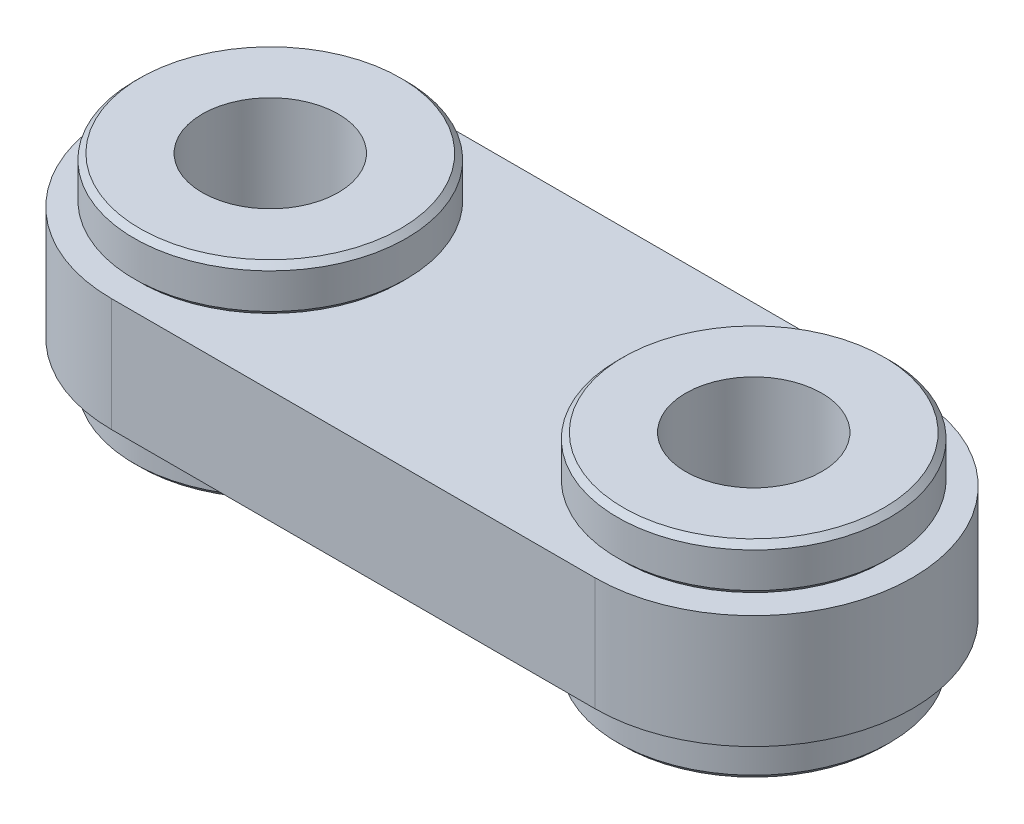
ISO-10303-21;
HEADER;
FILE_DESCRIPTION(('STEP AP214'),'2;1');
FILE_NAME('part.step','',(''),(''),'','','');
FILE_SCHEMA(('AUTOMOTIVE_DESIGN { 1 0 10303 214 1 1 1 1 }'));
ENDSEC;
DATA;
#1=APPLICATION_CONTEXT('core data for automotive mechanical design processes');
#2=APPLICATION_PROTOCOL_DEFINITION('international standard','automotive_design',2000,#1);
#3=PRODUCT_CONTEXT('',#1,'mechanical');
#4=PRODUCT('Part','Part','',(#3));
#5=PRODUCT_RELATED_PRODUCT_CATEGORY('part','',(#4));
#6=PRODUCT_DEFINITION_FORMATION('','',#4);
#7=PRODUCT_DEFINITION_CONTEXT('part definition',#1,'design');
#8=PRODUCT_DEFINITION('design','',#6,#7);
#9=PRODUCT_DEFINITION_SHAPE('','',#8);
#10=(LENGTH_UNIT() NAMED_UNIT(*) SI_UNIT(.MILLI.,.METRE.));
#11=(NAMED_UNIT(*) PLANE_ANGLE_UNIT() SI_UNIT($,.RADIAN.));
#12=(NAMED_UNIT(*) SI_UNIT($,.STERADIAN.) SOLID_ANGLE_UNIT());
#13=UNCERTAINTY_MEASURE_WITH_UNIT(LENGTH_MEASURE(1.E-05),#10,'distance_accuracy_value','');
#14=(GEOMETRIC_REPRESENTATION_CONTEXT(3) GLOBAL_UNCERTAINTY_ASSIGNED_CONTEXT((#13)) GLOBAL_UNIT_ASSIGNED_CONTEXT((#10,
#11,#12)) REPRESENTATION_CONTEXT('',''));
#15=CARTESIAN_POINT('',(0.,0.,0.));
#16=DIRECTION('',(0.,0.,1.));
#17=DIRECTION('',(1.,0.,0.));
#18=AXIS2_PLACEMENT_3D('',#15,#16,#17);
#19=CARTESIAN_POINT('',(0.,-2.5,0.));
#20=DIRECTION('',(0.,-1.,0.));
#21=DIRECTION('',(1.,0.,0.));
#22=AXIS2_PLACEMENT_3D('',#19,#20,#21);
#23=CYLINDRICAL_SURFACE('',#22,6.);
#24=CARTESIAN_POINT('',(0.,-4.3,0.));
#25=DIRECTION('',(0.,-1.,0.));
#26=DIRECTION('',(-1.,0.,0.));
#27=AXIS2_PLACEMENT_3D('',#24,#25,#26);
#28=CIRCLE('',#27,6.);
#29=CARTESIAN_POINT('',(-6.,-4.3,0.));
#30=VERTEX_POINT('',#29);
#31=EDGE_CURVE('E133',#30,#30,#28,.F.);
#32=ORIENTED_EDGE('',*,*,#31,.T.);
#33=EDGE_LOOP('',(#32));
#34=FACE_BOUND('',#33,.T.);
#35=CARTESIAN_POINT('',(0.,-2.7,0.));
#36=DIRECTION('',(0.,-1.,0.));
#37=DIRECTION('',(1.,0.,0.));
#38=AXIS2_PLACEMENT_3D('',#35,#36,#37);
#39=CIRCLE('',#38,6.);
#40=CARTESIAN_POINT('',(6.,-2.7,0.));
#41=VERTEX_POINT('',#40);
#42=EDGE_CURVE('E118',#41,#41,#39,.T.);
#43=ORIENTED_EDGE('',*,*,#42,.T.);
#44=EDGE_LOOP('',(#43));
#45=FACE_BOUND('',#44,.T.);
#46=ADVANCED_FACE('F14',(#34,#45),#23,.T.);
#47=CARTESIAN_POINT('',(0.,-4.6,0.));
#48=DIRECTION('',(0.,1.,0.));
#49=DIRECTION('',(-1.,0.,0.));
#50=AXIS2_PLACEMENT_3D('',#47,#48,#49);
#51=CYLINDRICAL_SURFACE('',#50,3.);
#52=CARTESIAN_POINT('',(0.,-4.55,0.));
#53=DIRECTION('',(0.,-1.,0.));
#54=DIRECTION('',(-1.,0.,0.));
#55=AXIS2_PLACEMENT_3D('',#52,#53,#54);
#56=CIRCLE('',#55,3.);
#57=CARTESIAN_POINT('',(-3.,-4.55,0.));
#58=VERTEX_POINT('',#57);
#59=EDGE_CURVE('E127',#58,#58,#56,.F.);
#60=ORIENTED_EDGE('',*,*,#59,.F.);
#61=EDGE_LOOP('',(#60));
#62=FACE_BOUND('',#61,.T.);
#63=CARTESIAN_POINT('',(0.,4.55,0.));
#64=DIRECTION('',(0.,1.,0.));
#65=DIRECTION('',(1.,0.,0.));
#66=AXIS2_PLACEMENT_3D('',#63,#64,#65);
#67=CIRCLE('',#66,3.);
#68=CARTESIAN_POINT('',(3.,4.55,0.));
#69=VERTEX_POINT('',#68);
#70=EDGE_CURVE('E130',#69,#69,#67,.T.);
#71=ORIENTED_EDGE('',*,*,#70,.T.);
#72=EDGE_LOOP('',(#71));
#73=FACE_BOUND('',#72,.T.);
#74=ADVANCED_FACE('F165',(#62,#73),#51,.F.);
#75=CARTESIAN_POINT('',(21.316,-2.5,-4.85722573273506E-13));
#76=DIRECTION('',(0.,-1.,0.));
#77=DIRECTION('',(1.,0.,0.));
#78=AXIS2_PLACEMENT_3D('',#75,#76,#77);
#79=CYLINDRICAL_SURFACE('',#78,6.);
#80=CARTESIAN_POINT('',(21.316,-4.3,-4.85722573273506E-13));
#81=DIRECTION('',(0.,-1.,0.));
#82=DIRECTION('',(-1.,0.,0.));
#83=AXIS2_PLACEMENT_3D('',#80,#81,#82);
#84=CIRCLE('',#83,6.);
#85=CARTESIAN_POINT('',(15.316,-4.3,-4.85722573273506E-13));
#86=VERTEX_POINT('',#85);
#87=EDGE_CURVE('E139',#86,#86,#84,.F.);
#88=ORIENTED_EDGE('',*,*,#87,.T.);
#89=EDGE_LOOP('',(#88));
#90=FACE_BOUND('',#89,.T.);
#91=CARTESIAN_POINT('',(21.316,-2.7,-4.85722573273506E-13));
#92=DIRECTION('',(0.,-1.,0.));
#93=DIRECTION('',(1.,0.,0.));
#94=AXIS2_PLACEMENT_3D('',#91,#92,#93);
#95=CIRCLE('',#94,6.);
#96=CARTESIAN_POINT('',(27.316,-2.7,-4.85722573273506E-13));
#97=VERTEX_POINT('',#96);
#98=EDGE_CURVE('E121',#97,#97,#95,.T.);
#99=ORIENTED_EDGE('',*,*,#98,.T.);
#100=EDGE_LOOP('',(#99));
#101=FACE_BOUND('',#100,.T.);
#102=ADVANCED_FACE('F172',(#90,#101),#79,.T.);
#103=CARTESIAN_POINT('',(21.316,-4.6,-4.85722573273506E-13));
#104=DIRECTION('',(0.,1.,0.));
#105=DIRECTION('',(-1.,0.,0.));
#106=AXIS2_PLACEMENT_3D('',#103,#104,#105);
#107=CYLINDRICAL_SURFACE('',#106,3.);
#108=CARTESIAN_POINT('',(21.316,-4.55,-4.85722573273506E-13));
#109=DIRECTION('',(0.,-1.,0.));
#110=DIRECTION('',(-1.,0.,0.));
#111=AXIS2_PLACEMENT_3D('',#108,#109,#110);
#112=CIRCLE('',#111,3.);
#113=CARTESIAN_POINT('',(18.316,-4.55,-4.85722573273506E-13));
#114=VERTEX_POINT('',#113);
#115=EDGE_CURVE('E124',#114,#114,#112,.F.);
#116=ORIENTED_EDGE('',*,*,#115,.F.);
#117=EDGE_LOOP('',(#116));
#118=FACE_BOUND('',#117,.T.);
#119=CARTESIAN_POINT('',(21.316,4.55,-4.85722573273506E-13));
#120=DIRECTION('',(0.,1.,0.));
#121=DIRECTION('',(1.,0.,0.));
#122=AXIS2_PLACEMENT_3D('',#119,#120,#121);
#123=CIRCLE('',#122,3.);
#124=CARTESIAN_POINT('',(24.316,4.55,-4.85722573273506E-13));
#125=VERTEX_POINT('',#124);
#126=EDGE_CURVE('E219',#125,#125,#123,.T.);
#127=ORIENTED_EDGE('',*,*,#126,.T.);
#128=EDGE_LOOP('',(#127));
#129=FACE_BOUND('',#128,.T.);
#130=ADVANCED_FACE('F187',(#118,#129),#107,.F.);
#131=CARTESIAN_POINT('',(0.,0.,0.));
#132=DIRECTION('',(0.,-1.,0.));
#133=DIRECTION('',(-1.,0.,0.));
#134=AXIS2_PLACEMENT_3D('',#131,#132,#133);
#135=CYLINDRICAL_SURFACE('',#134,7.);
#136=CARTESIAN_POINT('',(0.,-2.5,0.));
#137=DIRECTION('',(0.,1.,0.));
#138=DIRECTION('',(1.,0.,0.));
#139=AXIS2_PLACEMENT_3D('',#136,#137,#138);
#140=CIRCLE('',#139,7.);
#141=CARTESIAN_POINT('',(0.,-2.5,-7.));
#142=VERTEX_POINT('',#141);
#143=CARTESIAN_POINT('',(0.,-2.5,7.));
#144=VERTEX_POINT('',#143);
#145=EDGE_CURVE('E59',#142,#144,#140,.T.);
#146=ORIENTED_EDGE('',*,*,#145,.T.);
#147=DIRECTION('',(0.,-1.,0.));
#148=VECTOR('',#147,1.);
#149=CARTESIAN_POINT('',(0.,0.,7.));
#150=LINE('',#149,#148);
#151=CARTESIAN_POINT('',(0.,2.5,7.));
#152=VERTEX_POINT('',#151);
#153=EDGE_CURVE('E65',#152,#144,#150,.T.);
#154=ORIENTED_EDGE('',*,*,#153,.F.);
#155=CARTESIAN_POINT('',(0.,2.5,0.));
#156=DIRECTION('',(0.,1.,0.));
#157=DIRECTION('',(1.,0.,0.));
#158=AXIS2_PLACEMENT_3D('',#155,#156,#157);
#159=CIRCLE('',#158,7.);
#160=CARTESIAN_POINT('',(0.,2.5,-7.));
#161=VERTEX_POINT('',#160);
#162=EDGE_CURVE('E99',#161,#152,#159,.T.);
#163=ORIENTED_EDGE('',*,*,#162,.F.);
#164=DIRECTION('',(0.,-1.,0.));
#165=VECTOR('',#164,1.);
#166=CARTESIAN_POINT('',(0.,0.,-7.));
#167=LINE('',#166,#165);
#168=EDGE_CURVE('E67',#161,#142,#167,.T.);
#169=ORIENTED_EDGE('',*,*,#168,.T.);
#170=EDGE_LOOP('',(#146,#154,#163,#169));
#171=FACE_BOUND('',#170,.T.);
#172=ADVANCED_FACE('F63',(#171),#135,.T.);
#173=CARTESIAN_POINT('',(0.,0.,7.));
#174=DIRECTION('',(0.,0.,-1.));
#175=DIRECTION('',(0.,1.,0.));
#176=AXIS2_PLACEMENT_3D('',#173,#174,#175);
#177=PLANE('',#176);
#178=DIRECTION('',(1.,0.,0.));
#179=VECTOR('',#178,1.);
#180=CARTESIAN_POINT('',(0.,-2.5,7.));
#181=LINE('',#180,#179);
#182=CARTESIAN_POINT('',(21.316,-2.5,7.));
#183=VERTEX_POINT('',#182);
#184=EDGE_CURVE('E70',#144,#183,#181,.T.);
#185=ORIENTED_EDGE('',*,*,#184,.T.);
#186=DIRECTION('',(0.,-1.,0.));
#187=VECTOR('',#186,1.);
#188=CARTESIAN_POINT('',(21.316,0.,7.));
#189=LINE('',#188,#187);
#190=CARTESIAN_POINT('',(21.316,2.5,7.));
#191=VERTEX_POINT('',#190);
#192=EDGE_CURVE('E47',#191,#183,#189,.T.);
#193=ORIENTED_EDGE('',*,*,#192,.F.);
#194=DIRECTION('',(1.,0.,0.));
#195=VECTOR('',#194,1.);
#196=CARTESIAN_POINT('',(0.,2.5,7.));
#197=LINE('',#196,#195);
#198=EDGE_CURVE('E74',#152,#191,#197,.T.);
#199=ORIENTED_EDGE('',*,*,#198,.F.);
#200=ORIENTED_EDGE('',*,*,#153,.T.);
#201=EDGE_LOOP('',(#185,#193,#199,#200));
#202=FACE_BOUND('',#201,.T.);
#203=ADVANCED_FACE('F73',(#202),#177,.F.);
#204=CARTESIAN_POINT('',(21.316,0.,0.));
#205=DIRECTION('',(0.,-1.,0.));
#206=DIRECTION('',(-1.,0.,0.));
#207=AXIS2_PLACEMENT_3D('',#204,#205,#206);
#208=CYLINDRICAL_SURFACE('',#207,7.);
#209=CARTESIAN_POINT('',(21.316,-2.5,0.));
#210=DIRECTION('',(0.,1.,0.));
#211=DIRECTION('',(-1.,0.,0.));
#212=AXIS2_PLACEMENT_3D('',#209,#210,#211);
#213=CIRCLE('',#212,7.);
#214=CARTESIAN_POINT('',(21.316,-2.5,-7.));
#215=VERTEX_POINT('',#214);
#216=EDGE_CURVE('E31',#183,#215,#213,.T.);
#217=ORIENTED_EDGE('',*,*,#216,.T.);
#218=DIRECTION('',(0.,-1.,0.));
#219=VECTOR('',#218,1.);
#220=CARTESIAN_POINT('',(21.316,0.,-7.));
#221=LINE('',#220,#219);
#222=CARTESIAN_POINT('',(21.316,2.5,-7.));
#223=VERTEX_POINT('',#222);
#224=EDGE_CURVE('E51',#223,#215,#221,.T.);
#225=ORIENTED_EDGE('',*,*,#224,.F.);
#226=CARTESIAN_POINT('',(21.316,2.5,0.));
#227=DIRECTION('',(0.,1.,0.));
#228=DIRECTION('',(-1.,0.,0.));
#229=AXIS2_PLACEMENT_3D('',#226,#227,#228);
#230=CIRCLE('',#229,7.);
#231=EDGE_CURVE('E103',#191,#223,#230,.T.);
#232=ORIENTED_EDGE('',*,*,#231,.F.);
#233=ORIENTED_EDGE('',*,*,#192,.T.);
#234=EDGE_LOOP('',(#217,#225,#232,#233));
#235=FACE_BOUND('',#234,.T.);
#236=ADVANCED_FACE('F241',(#235),#208,.T.);
#237=CARTESIAN_POINT('',(21.316,0.,-7.));
#238=DIRECTION('',(0.,0.,1.));
#239=DIRECTION('',(0.,-1.,0.));
#240=AXIS2_PLACEMENT_3D('',#237,#238,#239);
#241=PLANE('',#240);
#242=DIRECTION('',(-1.,0.,0.));
#243=VECTOR('',#242,1.);
#244=CARTESIAN_POINT('',(21.316,-2.5,-7.));
#245=LINE('',#244,#243);
#246=EDGE_CURVE('E71',#215,#142,#245,.T.);
#247=ORIENTED_EDGE('',*,*,#246,.T.);
#248=ORIENTED_EDGE('',*,*,#168,.F.);
#249=DIRECTION('',(-1.,0.,0.));
#250=VECTOR('',#249,1.);
#251=CARTESIAN_POINT('',(21.316,2.5,-7.));
#252=LINE('',#251,#250);
#253=EDGE_CURVE('E101',#223,#161,#252,.T.);
#254=ORIENTED_EDGE('',*,*,#253,.F.);
#255=ORIENTED_EDGE('',*,*,#224,.T.);
#256=EDGE_LOOP('',(#247,#248,#254,#255));
#257=FACE_BOUND('',#256,.T.);
#258=ADVANCED_FACE('F239',(#257),#241,.F.);
#259=CARTESIAN_POINT('',(0.,-2.5,0.));
#260=DIRECTION('',(0.,1.,0.));
#261=DIRECTION('',(1.,0.,0.));
#262=AXIS2_PLACEMENT_3D('',#259,#260,#261);
#263=PLANE('',#262);
#264=CARTESIAN_POINT('',(21.316,-2.5,-4.85722573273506E-13));
#265=DIRECTION('',(0.,1.,0.));
#266=DIRECTION('',(1.,0.,0.));
#267=AXIS2_PLACEMENT_3D('',#264,#265,#266);
#268=CIRCLE('',#267,5.8);
#269=CARTESIAN_POINT('',(27.116,-2.5,-4.85722573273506E-13));
#270=VERTEX_POINT('',#269);
#271=EDGE_CURVE('E92',#270,#270,#268,.F.);
#272=ORIENTED_EDGE('',*,*,#271,.F.);
#273=EDGE_LOOP('',(#272));
#274=FACE_BOUND('',#273,.T.);
#275=ORIENTED_EDGE('',*,*,#246,.F.);
#276=ORIENTED_EDGE('',*,*,#216,.F.);
#277=ORIENTED_EDGE('',*,*,#184,.F.);
#278=ORIENTED_EDGE('',*,*,#145,.F.);
#279=EDGE_LOOP('',(#275,#276,#277,#278));
#280=FACE_BOUND('',#279,.T.);
#281=CARTESIAN_POINT('',(0.,-2.5,0.));
#282=DIRECTION('',(0.,1.,0.));
#283=DIRECTION('',(1.,0.,0.));
#284=AXIS2_PLACEMENT_3D('',#281,#282,#283);
#285=CIRCLE('',#284,5.8);
#286=CARTESIAN_POINT('',(5.8,-2.5,0.));
#287=VERTEX_POINT('',#286);
#288=EDGE_CURVE('E95',#287,#287,#285,.F.);
#289=ORIENTED_EDGE('',*,*,#288,.F.);
#290=EDGE_LOOP('',(#289));
#291=FACE_BOUND('',#290,.T.);
#292=ADVANCED_FACE('F76',(#274,#280,#291),#263,.F.);
#293=CARTESIAN_POINT('',(21.316,-2.5,-4.85722573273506E-13));
#294=DIRECTION('',(0.,-1.,0.));
#295=DIRECTION('',(1.,0.,0.));
#296=AXIS2_PLACEMENT_3D('',#293,#294,#295);
#297=CONICAL_SURFACE('',#296,5.8,0.785398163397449);
#298=ORIENTED_EDGE('',*,*,#98,.F.);
#299=EDGE_LOOP('',(#298));
#300=FACE_BOUND('',#299,.T.);
#301=ORIENTED_EDGE('',*,*,#271,.T.);
#302=EDGE_LOOP('',(#301));
#303=FACE_BOUND('',#302,.T.);
#304=ADVANCED_FACE('F182',(#300,#303),#297,.T.);
#305=CARTESIAN_POINT('',(0.,-2.5,0.));
#306=DIRECTION('',(0.,-1.,0.));
#307=DIRECTION('',(1.,0.,0.));
#308=AXIS2_PLACEMENT_3D('',#305,#306,#307);
#309=CONICAL_SURFACE('',#308,5.8,0.785398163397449);
#310=ORIENTED_EDGE('',*,*,#42,.F.);
#311=EDGE_LOOP('',(#310));
#312=FACE_BOUND('',#311,.T.);
#313=ORIENTED_EDGE('',*,*,#288,.T.);
#314=EDGE_LOOP('',(#313));
#315=FACE_BOUND('',#314,.T.);
#316=ADVANCED_FACE('F178',(#312,#315),#309,.T.);
#317=CARTESIAN_POINT('',(21.316,-4.6,-4.85722573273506E-13));
#318=DIRECTION('',(0.,1.,0.));
#319=DIRECTION('',(-1.,0.,0.));
#320=AXIS2_PLACEMENT_3D('',#317,#318,#319);
#321=CYLINDRICAL_SURFACE('',#320,6.);
#322=CARTESIAN_POINT('',(21.316,4.3,-4.85722573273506E-13));
#323=DIRECTION('',(0.,1.,0.));
#324=DIRECTION('',(1.,0.,0.));
#325=AXIS2_PLACEMENT_3D('',#322,#323,#324);
#326=CIRCLE('',#325,6.);
#327=CARTESIAN_POINT('',(27.316,4.3,-4.85722573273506E-13));
#328=VERTEX_POINT('',#327);
#329=EDGE_CURVE('E145',#328,#328,#326,.F.);
#330=ORIENTED_EDGE('',*,*,#329,.T.);
#331=EDGE_LOOP('',(#330));
#332=FACE_BOUND('',#331,.T.);
#333=CARTESIAN_POINT('',(21.316,2.75,-4.85722573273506E-13));
#334=DIRECTION('',(0.,1.,0.));
#335=DIRECTION('',(-1.,0.,0.));
#336=AXIS2_PLACEMENT_3D('',#333,#334,#335);
#337=CIRCLE('',#336,6.);
#338=CARTESIAN_POINT('',(15.316,2.75,-4.85722573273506E-13));
#339=VERTEX_POINT('',#338);
#340=EDGE_CURVE('E108',#339,#339,#337,.T.);
#341=ORIENTED_EDGE('',*,*,#340,.T.);
#342=EDGE_LOOP('',(#341));
#343=FACE_BOUND('',#342,.T.);
#344=ADVANCED_FACE('F181',(#332,#343),#321,.T.);
#345=CARTESIAN_POINT('',(0.,-4.6,0.));
#346=DIRECTION('',(0.,1.,0.));
#347=DIRECTION('',(-1.,0.,0.));
#348=AXIS2_PLACEMENT_3D('',#345,#346,#347);
#349=CYLINDRICAL_SURFACE('',#348,6.);
#350=CARTESIAN_POINT('',(0.,4.3,0.));
#351=DIRECTION('',(0.,1.,0.));
#352=DIRECTION('',(1.,0.,0.));
#353=AXIS2_PLACEMENT_3D('',#350,#351,#352);
#354=CIRCLE('',#353,6.);
#355=CARTESIAN_POINT('',(6.,4.3,0.));
#356=VERTEX_POINT('',#355);
#357=EDGE_CURVE('E9',#356,#356,#354,.F.);
#358=ORIENTED_EDGE('',*,*,#357,.T.);
#359=EDGE_LOOP('',(#358));
#360=FACE_BOUND('',#359,.T.);
#361=CARTESIAN_POINT('',(0.,2.75,0.));
#362=DIRECTION('',(0.,1.,0.));
#363=DIRECTION('',(-1.,0.,0.));
#364=AXIS2_PLACEMENT_3D('',#361,#362,#363);
#365=CIRCLE('',#364,6.);
#366=CARTESIAN_POINT('',(-6.,2.75,0.));
#367=VERTEX_POINT('',#366);
#368=EDGE_CURVE('E115',#367,#367,#365,.T.);
#369=ORIENTED_EDGE('',*,*,#368,.T.);
#370=EDGE_LOOP('',(#369));
#371=FACE_BOUND('',#370,.T.);
#372=ADVANCED_FACE('F255',(#360,#371),#349,.T.);
#373=CARTESIAN_POINT('',(21.316,2.5,-4.85722573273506E-13));
#374=DIRECTION('',(0.,1.,0.));
#375=DIRECTION('',(-1.,0.,0.));
#376=AXIS2_PLACEMENT_3D('',#373,#374,#375);
#377=CONICAL_SURFACE('',#376,5.75,0.785398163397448);
#378=ORIENTED_EDGE('',*,*,#340,.F.);
#379=EDGE_LOOP('',(#378));
#380=FACE_BOUND('',#379,.T.);
#381=CARTESIAN_POINT('',(21.316,2.5,-4.85722573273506E-13));
#382=DIRECTION('',(0.,1.,0.));
#383=DIRECTION('',(1.,0.,0.));
#384=AXIS2_PLACEMENT_3D('',#381,#382,#383);
#385=CIRCLE('',#384,5.75);
#386=CARTESIAN_POINT('',(27.066,2.5,-4.85722573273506E-13));
#387=VERTEX_POINT('',#386);
#388=EDGE_CURVE('E88',#387,#387,#385,.F.);
#389=ORIENTED_EDGE('',*,*,#388,.F.);
#390=EDGE_LOOP('',(#389));
#391=FACE_BOUND('',#390,.T.);
#392=ADVANCED_FACE('F184',(#380,#391),#377,.T.);
#393=CARTESIAN_POINT('',(0.,2.5,0.));
#394=DIRECTION('',(0.,1.,0.));
#395=DIRECTION('',(-1.,0.,0.));
#396=AXIS2_PLACEMENT_3D('',#393,#394,#395);
#397=CONICAL_SURFACE('',#396,5.75,0.785398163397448);
#398=ORIENTED_EDGE('',*,*,#368,.F.);
#399=EDGE_LOOP('',(#398));
#400=FACE_BOUND('',#399,.T.);
#401=CARTESIAN_POINT('',(0.,2.5,0.));
#402=DIRECTION('',(0.,1.,0.));
#403=DIRECTION('',(1.,0.,0.));
#404=AXIS2_PLACEMENT_3D('',#401,#402,#403);
#405=CIRCLE('',#404,5.75);
#406=CARTESIAN_POINT('',(5.75,2.5,0.));
#407=VERTEX_POINT('',#406);
#408=EDGE_CURVE('E105',#407,#407,#405,.F.);
#409=ORIENTED_EDGE('',*,*,#408,.F.);
#410=EDGE_LOOP('',(#409));
#411=FACE_BOUND('',#410,.T.);
#412=ADVANCED_FACE('F253',(#400,#411),#397,.T.);
#413=CARTESIAN_POINT('',(0.,2.5,0.));
#414=DIRECTION('',(0.,1.,0.));
#415=DIRECTION('',(1.,0.,0.));
#416=AXIS2_PLACEMENT_3D('',#413,#414,#415);
#417=PLANE('',#416);
#418=ORIENTED_EDGE('',*,*,#408,.T.);
#419=EDGE_LOOP('',(#418));
#420=FACE_BOUND('',#419,.T.);
#421=ORIENTED_EDGE('',*,*,#253,.T.);
#422=ORIENTED_EDGE('',*,*,#162,.T.);
#423=ORIENTED_EDGE('',*,*,#198,.T.);
#424=ORIENTED_EDGE('',*,*,#231,.T.);
#425=EDGE_LOOP('',(#421,#422,#423,#424));
#426=FACE_BOUND('',#425,.T.);
#427=ORIENTED_EDGE('',*,*,#388,.T.);
#428=EDGE_LOOP('',(#427));
#429=FACE_BOUND('',#428,.T.);
#430=ADVANCED_FACE('F210',(#420,#426,#429),#417,.T.);
#431=CARTESIAN_POINT('',(21.316,-4.55,-4.85722573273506E-13));
#432=DIRECTION('',(0.,-1.,0.));
#433=DIRECTION('',(-1.,0.,0.));
#434=AXIS2_PLACEMENT_3D('',#431,#432,#433);
#435=PLANE('',#434);
#436=CARTESIAN_POINT('',(21.316,-4.55,-4.85722573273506E-13));
#437=DIRECTION('',(0.,-1.,0.));
#438=DIRECTION('',(-1.,0.,0.));
#439=AXIS2_PLACEMENT_3D('',#436,#437,#438);
#440=CIRCLE('',#439,5.75);
#441=CARTESIAN_POINT('',(15.566,-4.55,-4.85722573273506E-13));
#442=VERTEX_POINT('',#441);
#443=EDGE_CURVE('E136',#442,#442,#440,.T.);
#444=ORIENTED_EDGE('',*,*,#443,.T.);
#445=EDGE_LOOP('',(#444));
#446=FACE_BOUND('',#445,.T.);
#447=ORIENTED_EDGE('',*,*,#115,.T.);
#448=EDGE_LOOP('',(#447));
#449=FACE_BOUND('',#448,.T.);
#450=ADVANCED_FACE('F206',(#446,#449),#435,.T.);
#451=CARTESIAN_POINT('',(0.,-4.55,0.));
#452=DIRECTION('',(0.,-1.,0.));
#453=DIRECTION('',(-1.,0.,0.));
#454=AXIS2_PLACEMENT_3D('',#451,#452,#453);
#455=PLANE('',#454);
#456=CARTESIAN_POINT('',(0.,-4.55,0.));
#457=DIRECTION('',(0.,-1.,0.));
#458=DIRECTION('',(-1.,0.,0.));
#459=AXIS2_PLACEMENT_3D('',#456,#457,#458);
#460=CIRCLE('',#459,5.75);
#461=CARTESIAN_POINT('',(-5.75,-4.55,0.));
#462=VERTEX_POINT('',#461);
#463=EDGE_CURVE('E98',#462,#462,#460,.T.);
#464=ORIENTED_EDGE('',*,*,#463,.T.);
#465=EDGE_LOOP('',(#464));
#466=FACE_BOUND('',#465,.T.);
#467=ORIENTED_EDGE('',*,*,#59,.T.);
#468=EDGE_LOOP('',(#467));
#469=FACE_BOUND('',#468,.T.);
#470=ADVANCED_FACE('F209',(#466,#469),#455,.T.);
#471=CARTESIAN_POINT('',(0.,4.55,0.));
#472=DIRECTION('',(0.,1.,0.));
#473=DIRECTION('',(1.,0.,0.));
#474=AXIS2_PLACEMENT_3D('',#471,#472,#473);
#475=PLANE('',#474);
#476=CARTESIAN_POINT('',(0.,4.55,0.));
#477=DIRECTION('',(0.,1.,0.));
#478=DIRECTION('',(1.,0.,0.));
#479=AXIS2_PLACEMENT_3D('',#476,#477,#478);
#480=CIRCLE('',#479,5.75);
#481=CARTESIAN_POINT('',(5.75,4.55,0.));
#482=VERTEX_POINT('',#481);
#483=EDGE_CURVE('E23',#482,#482,#480,.T.);
#484=ORIENTED_EDGE('',*,*,#483,.T.);
#485=EDGE_LOOP('',(#484));
#486=FACE_BOUND('',#485,.T.);
#487=ORIENTED_EDGE('',*,*,#70,.F.);
#488=EDGE_LOOP('',(#487));
#489=FACE_BOUND('',#488,.T.);
#490=ADVANCED_FACE('F150',(#486,#489),#475,.T.);
#491=CARTESIAN_POINT('',(21.316,4.55,-4.85722573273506E-13));
#492=DIRECTION('',(0.,1.,0.));
#493=DIRECTION('',(1.,0.,0.));
#494=AXIS2_PLACEMENT_3D('',#491,#492,#493);
#495=PLANE('',#494);
#496=CARTESIAN_POINT('',(21.316,4.55,-4.85722573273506E-13));
#497=DIRECTION('',(0.,1.,0.));
#498=DIRECTION('',(1.,0.,0.));
#499=AXIS2_PLACEMENT_3D('',#496,#497,#498);
#500=CIRCLE('',#499,5.75);
#501=CARTESIAN_POINT('',(27.066,4.55,-4.85722573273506E-13));
#502=VERTEX_POINT('',#501);
#503=EDGE_CURVE('E142',#502,#502,#500,.T.);
#504=ORIENTED_EDGE('',*,*,#503,.T.);
#505=EDGE_LOOP('',(#504));
#506=FACE_BOUND('',#505,.T.);
#507=ORIENTED_EDGE('',*,*,#126,.F.);
#508=EDGE_LOOP('',(#507));
#509=FACE_BOUND('',#508,.T.);
#510=ADVANCED_FACE('F195',(#506,#509),#495,.T.);
#511=CARTESIAN_POINT('',(0.,-4.55,0.));
#512=DIRECTION('',(0.,1.,0.));
#513=DIRECTION('',(1.,0.,0.));
#514=AXIS2_PLACEMENT_3D('',#511,#512,#513);
#515=CONICAL_SURFACE('',#514,5.75,0.785398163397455);
#516=ORIENTED_EDGE('',*,*,#31,.F.);
#517=EDGE_LOOP('',(#516));
#518=FACE_BOUND('',#517,.T.);
#519=ORIENTED_EDGE('',*,*,#463,.F.);
#520=EDGE_LOOP('',(#519));
#521=FACE_BOUND('',#520,.T.);
#522=ADVANCED_FACE('F192',(#518,#521),#515,.T.);
#523=CARTESIAN_POINT('',(21.316,-4.55,-4.85722573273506E-13));
#524=DIRECTION('',(0.,1.,0.));
#525=DIRECTION('',(1.,0.,0.));
#526=AXIS2_PLACEMENT_3D('',#523,#524,#525);
#527=CONICAL_SURFACE('',#526,5.75,0.785398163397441);
#528=ORIENTED_EDGE('',*,*,#87,.F.);
#529=EDGE_LOOP('',(#528));
#530=FACE_BOUND('',#529,.T.);
#531=ORIENTED_EDGE('',*,*,#443,.F.);
#532=EDGE_LOOP('',(#531));
#533=FACE_BOUND('',#532,.T.);
#534=ADVANCED_FACE('F161',(#530,#533),#527,.T.);
#535=CARTESIAN_POINT('',(21.316,4.55,-4.85722573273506E-13));
#536=DIRECTION('',(0.,-1.,0.));
#537=DIRECTION('',(-1.,0.,0.));
#538=AXIS2_PLACEMENT_3D('',#535,#536,#537);
#539=CONICAL_SURFACE('',#538,5.75,0.785398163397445);
#540=ORIENTED_EDGE('',*,*,#329,.F.);
#541=EDGE_LOOP('',(#540));
#542=FACE_BOUND('',#541,.T.);
#543=ORIENTED_EDGE('',*,*,#503,.F.);
#544=EDGE_LOOP('',(#543));
#545=FACE_BOUND('',#544,.T.);
#546=ADVANCED_FACE('F154',(#542,#545),#539,.T.);
#547=CARTESIAN_POINT('',(0.,4.55,0.));
#548=DIRECTION('',(0.,-1.,0.));
#549=DIRECTION('',(-1.,0.,0.));
#550=AXIS2_PLACEMENT_3D('',#547,#548,#549);
#551=CONICAL_SURFACE('',#550,5.75,0.785398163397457);
#552=ORIENTED_EDGE('',*,*,#357,.F.);
#553=EDGE_LOOP('',(#552));
#554=FACE_BOUND('',#553,.T.);
#555=ORIENTED_EDGE('',*,*,#483,.F.);
#556=EDGE_LOOP('',(#555));
#557=FACE_BOUND('',#556,.T.);
#558=ADVANCED_FACE('F16',(#554,#557),#551,.T.);
#559=CLOSED_SHELL('',(#46,#74,#102,#130,#172,#203,#236,#258,#292,#304,#316,#344,#372,#392,#412,
#430,#450,#470,#490,#510,#522,#534,#546,#558));
#560=MANIFOLD_SOLID_BREP('B1',#559);
#561=ADVANCED_BREP_SHAPE_REPRESENTATION('',(#18,#560),#14);
#562=SHAPE_DEFINITION_REPRESENTATION(#9,#561);
ENDSEC;
END-ISO-10303-21;
